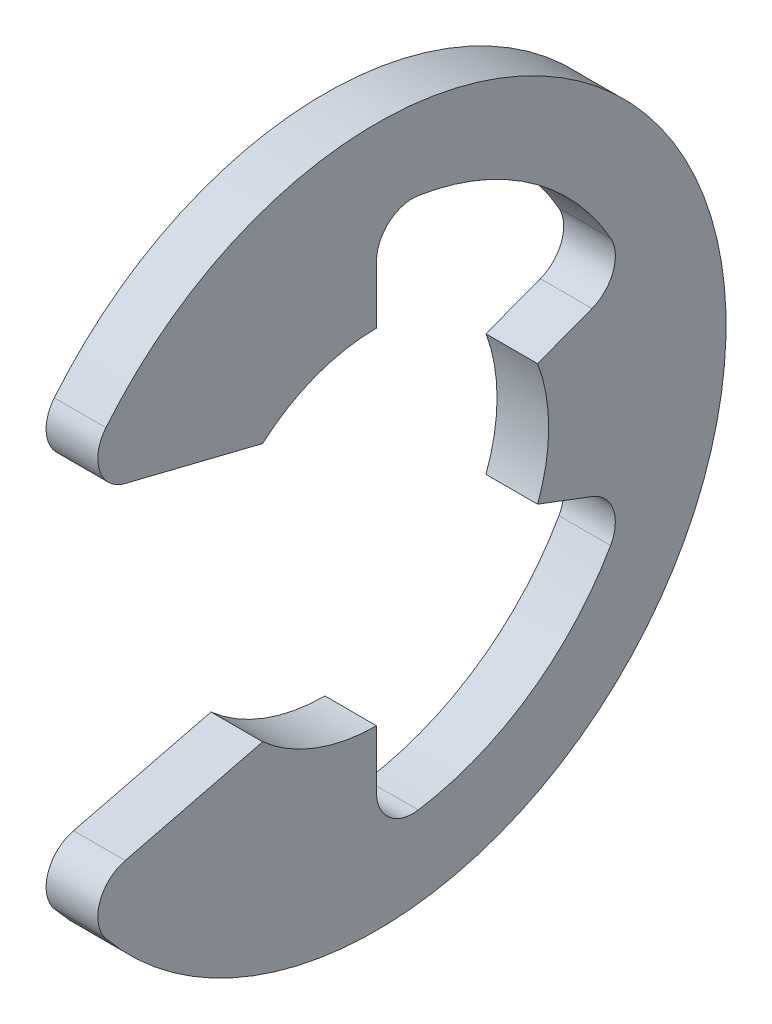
from build123d import *

# Parameters (mm, degrees)
EXTRUDE1_DEPTH = 0.1905
FILLET1_R      = 0.2667


with BuildPart() as part:
    # Sketch1 → Extrude1 (new, symmetric)
    with BuildSketch(Plane(origin=(0, 0, 0), x_dir=(0, 0, -1), z_dir=(1, 0, 0))):
        with BuildLine():
            Line((-2.228034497, -1.297097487), (-0.840026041, -0.9525))
            ThreePointArc((-0.840026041, -0.9525), (-0.449012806, -1.18797622), (0, -1.27))
            Line((0, -1.27), (0, -1.986116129))
            ThreePointArc((0, -1.986116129), (1.129161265, -1.63390701), (1.857841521, -0.702198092))
            Line((1.857841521, -0.702198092), (1.18797622, -0.449012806))
            ThreePointArc((1.18797622, -0.449012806), (1.27, 0), (1.18797622, 0.449012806))
            Line((1.18797622, 0.449012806), (1.857841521, 0.702198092))
            ThreePointArc((1.857841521, 0.702198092), (1.129161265, 1.63390701), (0, 1.986116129))
            Line((0, 1.986116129), (0, 1.27))
            ThreePointArc((0, 1.27), (-0.449012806, 1.18797622), (-0.840026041, 0.9525))
            Line((-0.840026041, 0.9525), (-2.228034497, 1.297097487))
            ThreePointArc((-2.228034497, 1.297097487), (2.5781, 0), (-2.228034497, -1.297097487))
        make_face()
    extrude(amount=EXTRUDE1_DEPTH, both=True)

    # Fillet1
    fillet1_edges = [part.edges().sort_by_distance(p)[0] for p in [
        (0, -1.297097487, 2.228034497),
        (0, -1.986116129, 0),
        (0, -0.702198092, -1.857841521),
        (0, 0.702198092, -1.857841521),
        (0, 1.986116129, 0),
        (0, 1.297097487, 2.228034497),
    ]]
    fillet(fillet1_edges, radius=FILLET1_R)


solid = part.part
